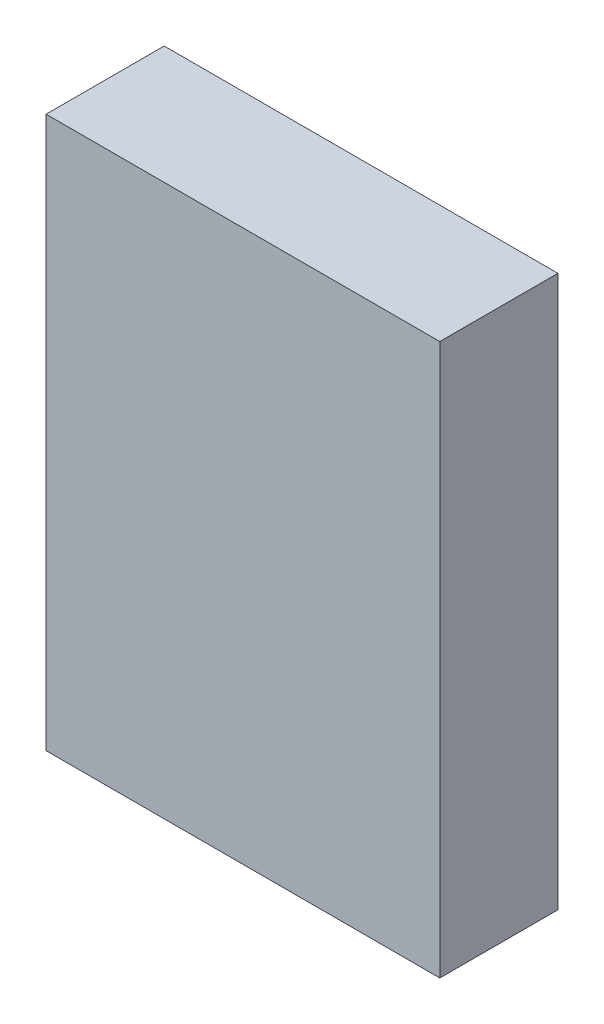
from build123d import *

# Parameters (mm, degrees)
SKETCH_1_W          = 20
SKETCH_1_H          = 6
EXTRUDE_1_DEPTH     = 28
SKETCH_2_W          = 10
SKETCH_2_H          = 1.5
CUT_EXTRUDE_1_DEPTH = 25


with BuildPart() as part:
    # Sketch 1 → Extrude 1 (new body)
    with BuildSketch(Plane(origin=(0, 0, 0), x_dir=(1, 0, 0), z_dir=(0, 1, 0))):
        Rectangle(SKETCH_1_W, SKETCH_1_H)
    extrude(amount=EXTRUDE_1_DEPTH)

    # Sketch 2 → Cut-Extrude 1 (cut)
    with BuildSketch(Plane.XZ):
        Rectangle(SKETCH_2_W, SKETCH_2_H)
    extrude(amount=-CUT_EXTRUDE_1_DEPTH, mode=Mode.SUBTRACT)


solid = part.part
